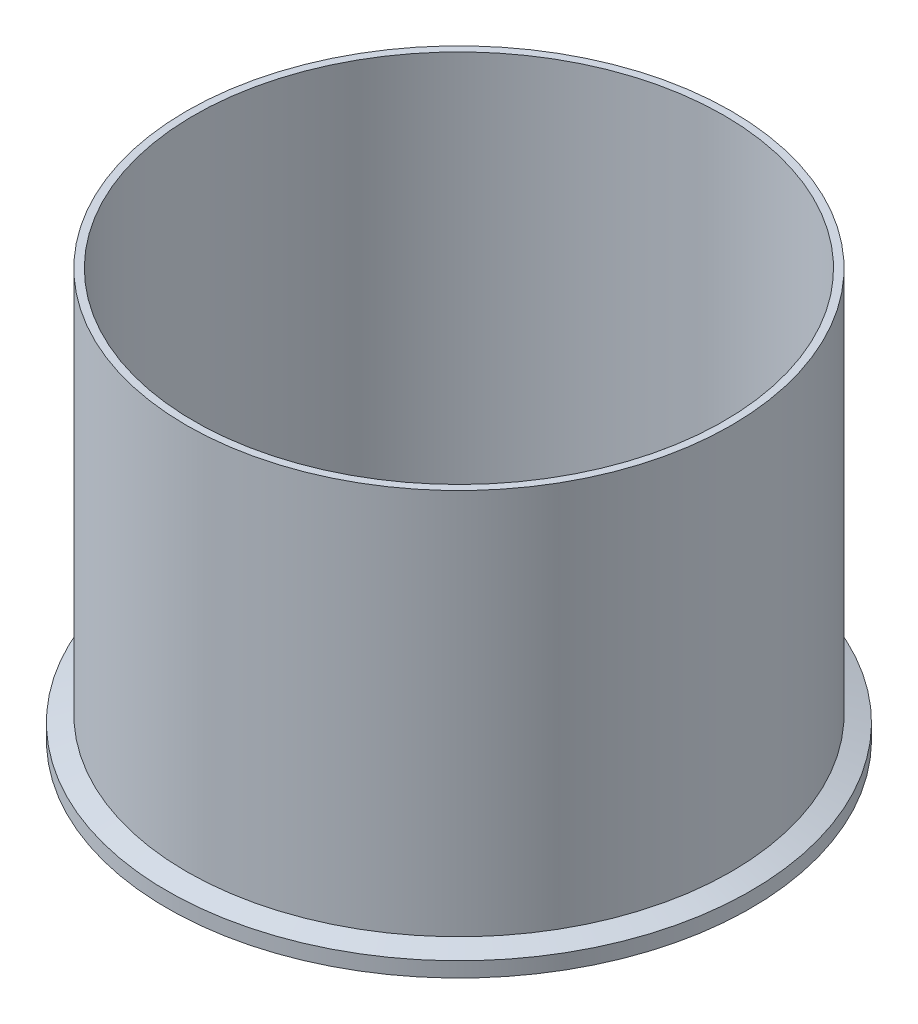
from build123d import *


with BuildPart() as part:
    # Sketch1 → Revolve2 (revolve)
    with BuildSketch(Plane.XY, mode=Mode.PRIVATE) as revolve2_sk:
        with BuildLine():
            Line((-98.8314, 0), (-98.8314, 152.4))
            Line((-98.8314, 152.4), (-101.6, 152.4))
            Line((-101.6, 152.4), (-101.6, 8.222780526))
            Line((-101.6, 8.222780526), (-108.839, 5.588))
            Line((-108.839, 5.588), (-108.839, 0))
            Line((-108.839, 0), (-105.399208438, 0))
            ThreePointArc((-105.399208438, 0), (-104.967011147, 0.129217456), (-104.676666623, 0.474458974))
            ThreePointArc((-104.676666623, 0.474458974), (-103.5812, 1.1938), (-102.485733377, 0.474458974))
            ThreePointArc((-102.485733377, 0.474458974), (-102.195388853, 0.129217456), (-101.763191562, 0))
            Line((-101.763191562, 0), (-98.8314, 0))
        make_face()
    revolve(revolve2_sk.sketch.rotate(Axis((0, 0, 0), (0, 1, 0)), 270), axis=Axis((0, 0, 0), (0, 1, 0)))


solid = part.part
